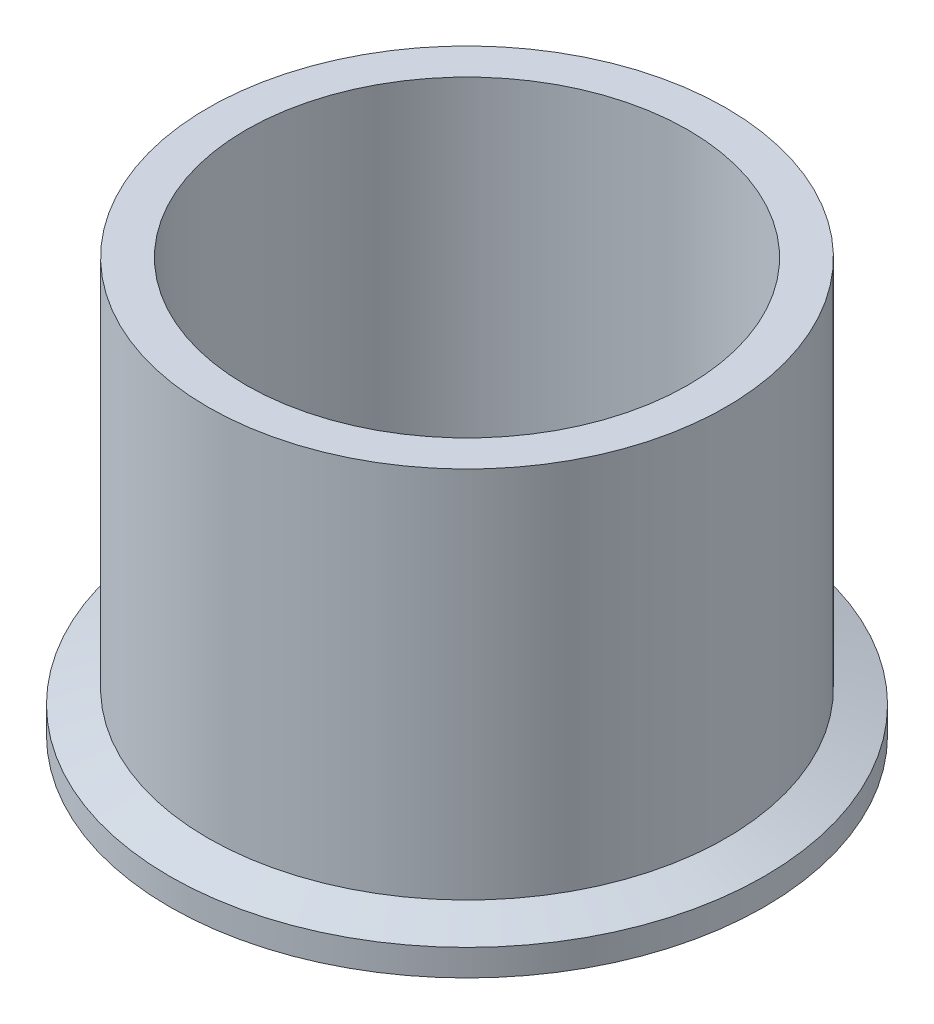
from build123d import *


with BuildPart() as part:
    # Sketch1 → Revolve2 (revolve)
    with BuildSketch(Plane.XY, mode=Mode.PRIVATE) as revolve2_sk:
        with BuildLine():
            Line((-23.749, 0), (-23.749, 44.45))
            Line((-23.749, 44.45), (-27.8384, 44.45))
            Line((-27.8384, 44.45), (-27.8384, 4.34246472))
            Line((-27.8384, 4.34246472), (-31.9532, 2.8448))
            Line((-31.9532, 2.8448), (-31.9532, 0))
            Line((-31.9532, 0), (-29.974241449, 0))
            ThreePointArc((-29.974241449, 0), (-29.69385746, 0.084386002), (-29.506624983, 0.309508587))
            Line((-29.506624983, 0.309508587), (-29.267498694, 0.872854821))
            ThreePointArc((-29.267498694, 0.872854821), (-28.1686, 1.6002), (-27.069701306, 0.872854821))
            Line((-27.069701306, 0.872854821), (-26.830575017, 0.309508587))
            ThreePointArc((-26.830575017, 0.309508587), (-26.64334254, 0.084386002), (-26.362958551, 0))
            Line((-26.362958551, 0), (-23.749, 0))
        make_face()
    revolve(revolve2_sk.sketch.rotate(Axis((0, 0, 0), (0, 1, 0)), 270), axis=Axis((0, 0, 0), (0, 1, 0)))


solid = part.part
